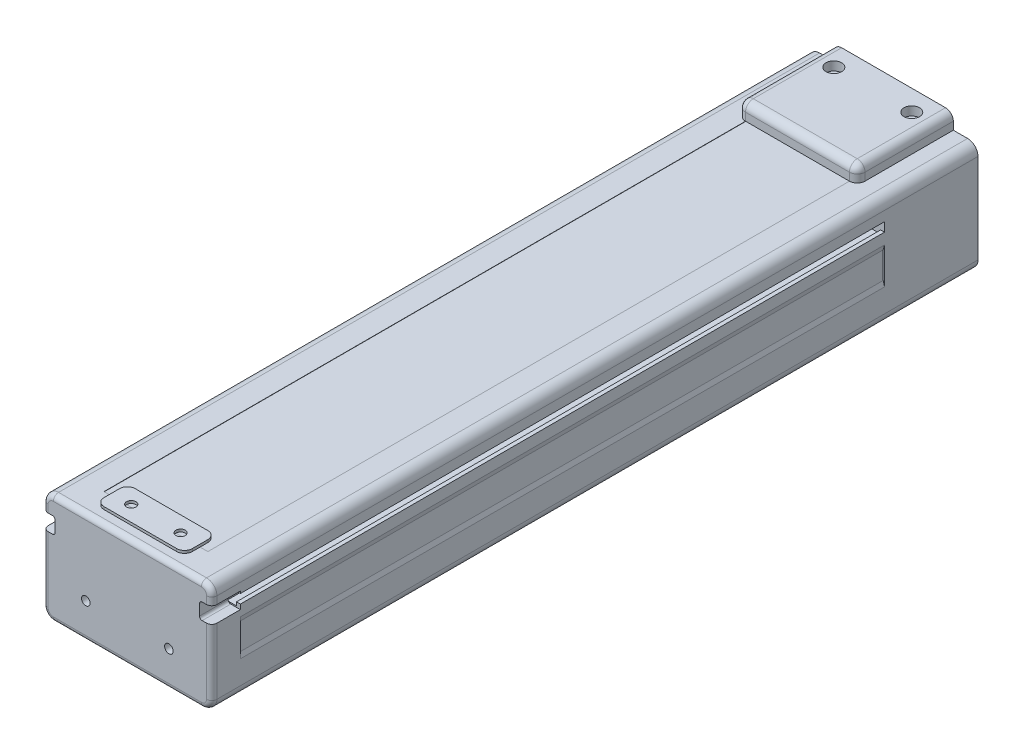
from build123d import *

# Parameters (mm, degrees)
EXTRUDE_1_DEPTH                     = 259
HOLE_WIZARD_M4_1_D                  = 4.4
HOLE_WIZARD_M4_1_CBORE_D            = 8
HOLE_WIZARD_M4_1_CBORE_DEPTH        = 4.2
PATTERN_LINEAR_1_COUNT              = 2
PATTERN_LINEAR_1_PITCH              = 23
PATTERN_LINEAR_2_COUNT              = 2
PATTERN_LINEAR_2_PITCH              = 11
PATTERN_LINEAR_2_COPY_1_D           = 4.4
PATTERN_LINEAR_2_COPY_1_CBORE_D     = 8
PATTERN_LINEAR_2_COPY_1_CBORE_DEPTH = 4.2
HOLE_WIZARD_M5_1_D                  = 4.2
PATTERN_LINEAR_4_COUNT              = 2
PATTERN_LINEAR_4_PITCH              = 23
PATTERN_LINEAR_5_COUNT              = 6
PATTERN_LINEAR_5_PITCH              = 40
PATTERN_LINEAR_5_COPY_1_D           = 4.2
PATTERN_LINEAR_5_COPY_2_D           = 4.2
PATTERN_LINEAR_5_COPY_3_D           = 4.2
PATTERN_LINEAR_5_COPY_4_D           = 4.2
PATTERN_LINEAR_5_COPY_5_D           = 4.2
HOLE_WIZARD_M4_2_D                  = 4.4
HOLE_WIZARD_M4_2_CBORE_D            = 8
HOLE_WIZARD_M4_2_CBORE_DEPTH        = 4.2
EXTRUDE_2_DEPTH                     = 248
EXTRUDE_6_DEPTH                     = 11
FILLET_1_R                          = 1
FILLET_2_R                          = 4
EXTRUDE_7_DEPTH                     = 36
CUT_EXTRUDE_1_DEPTH                 = 9
EXTRUDE_8_DEPTH                     = 6
FILLET_3_R                          = 3
SKETCH_14_W                         = 40
SKETCH_14_H                         = 257
CUT_EXTRUDE_2_DEPTH                 = 0.1
SKETCH_15_W                         = 34
SKETCH_15_H                         = 12
SKETCH_15_R                         = 1.8
EXTRUDE_9_DEPTH                     = 1
FILLET_4_R                          = 3
HOLE_WIZARD_M3_1_D                  = 3.4
HOLE_WIZARD_M3_1_DEPTH              = 6
HOLE_WIZARD_M3_1_CBORE_D            = 6
HOLE_WIZARD_M3_1_CBORE_DEPTH        = 3.4
HOLE_WIZARD_M3_1_TIP                = 1.021463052
HOLE_WIZARD_M4_3_D                  = 4.4
HOLE_WIZARD_M4_3_DEPTH              = 10
HOLE_WIZARD_M4_3_CBORE_D            = 8
HOLE_WIZARD_M4_3_CBORE_DEPTH        = 4.2
HOLE_WIZARD_M4_3_TIP                = 1.321893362
FILLET_5_R                          = 2
HOLE_WIZARD_M4_1_2_D                = 3.3
HOLE_WIZARD_M4_1_2_DEPTH            = 14.1
HOLE_WIZARD_M4_1_2_TIP              = 0.991420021


with BuildPart() as part:
    # Sketch 1 → Extrude 1 (new body)
    with BuildSketch(Plane.XY):
        with BuildLine():
            Line((-20.85, 3.480384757), (-20.4, 3.740192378))
            ThreePointArc((-20.4, 3.740192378), (-20.290192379, 3.85), (-20.25, 4))
            Line((-20.25, 4), (-20.25, 5.134886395))
            ThreePointArc((-20.25, 5.134886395), (-19.030626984, 6.766047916), (-20.250994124, 8.396465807))
            Line((-20.250994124, 8.396465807), (-20.628312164, 9.05))
            ThreePointArc((-20.628312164, 9.05), (-20.628312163, 9.35), (-20.368504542, 9.5))
            Line((-20.368504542, 9.5), (20.368504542, 9.5))
            ThreePointArc((20.368504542, 9.5), (20.628312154, 9.350000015), (20.628312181, 9.050000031))
            Line((20.628312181, 9.050000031), (20.250994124, 8.396465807))
            ThreePointArc((20.250994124, 8.396465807), (19.030626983, 6.766047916), (20.25, 5.134886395))
            Line((20.25, 5.134886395), (20.25, 3.999999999))
            ThreePointArc((20.25, 3.999999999), (20.290192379, 3.85), (20.4, 3.740192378))
            Line((20.4, 3.740192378), (20.85, 3.480384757))
            ThreePointArc((20.85, 3.480384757), (20.959807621, 3.370577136), (21, 3.220577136))
            Line((21, 3.220577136), (21, 0.815685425))
            Line((21, 0.815685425), (20.184314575, 0))
            Line((20.184314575, 0), (9, 0))
            Line((9, 0), (8.5, 0.5))
            Line((8.5, 0.5), (-8.5, 0.5))
            Line((-8.5, 0.5), (-9, 0))
            Line((-9, 0), (-20.184314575, 0))
            Line((-20.184314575, 0), (-21, 0.815685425))
            Line((-21, 0.815685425), (-21, 3.220577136))
            ThreePointArc((-21, 3.220577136), (-20.959807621, 3.370577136), (-20.85, 3.480384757))
        make_face()
    extrude(amount=EXTRUDE_1_DEPTH)

    # Hole Wizard M4 _1 (through all)
    with Locations(Plane(origin=(-11.5, 0, 5), x_dir=(0, 0, -1), z_dir=(0, -1, 0))):
        with Locations((0, 0)):
            hole_wizard_m4_1 = CounterBoreHole(HOLE_WIZARD_M4_1_D / 2, HOLE_WIZARD_M4_1_CBORE_D / 2, HOLE_WIZARD_M4_1_CBORE_DEPTH)

    # Pattern Linear 1: Hole Wizard M4 _1 ×2
    with Locations(*[(i * PATTERN_LINEAR_1_PITCH, 0, 0) for i in range(1, PATTERN_LINEAR_1_COUNT)]):
        add(hole_wizard_m4_1, mode=Mode.SUBTRACT)

    # Pattern Linear 2: Hole Wizard M4 _1 ×2
    with Locations(*[(0, 0, i * PATTERN_LINEAR_2_PITCH) for i in range(1, PATTERN_LINEAR_2_COUNT)]):
        add(hole_wizard_m4_1, mode=Mode.SUBTRACT)

    # Pattern Linear 2 copy 1 (through all)
    with Locations(Plane(origin=(11.5, 0, 16), x_dir=(0, 0, -1), z_dir=(0, -1, 0))):
        with Locations((0, 0)):
            CounterBoreHole(PATTERN_LINEAR_2_COPY_1_D / 2, PATTERN_LINEAR_2_COPY_1_CBORE_D / 2, PATTERN_LINEAR_2_COPY_1_CBORE_DEPTH)

    # Hole Wizard M5 _1 (through all)
    with Locations(Plane(origin=(-11.5, 9.5, 34), x_dir=(0, 0, 1), z_dir=(0, 1, 0))):
        with Locations((0, 0)):
            hole_wizard_m5_1 = Hole(HOLE_WIZARD_M5_1_D / 2)

    # Pattern Linear 4: Hole Wizard M5 _1 ×2
    with Locations(*[(i * PATTERN_LINEAR_4_PITCH, 0, 0) for i in range(1, PATTERN_LINEAR_4_COUNT)]):
        add(hole_wizard_m5_1, mode=Mode.SUBTRACT)

    # Pattern Linear 5: Hole Wizard M5 _1 ×6
    with Locations(*[(0, 0, i * PATTERN_LINEAR_5_PITCH) for i in range(1, PATTERN_LINEAR_5_COUNT)]):
        add(hole_wizard_m5_1, mode=Mode.SUBTRACT)

    # Pattern Linear 5 copy 1 (through all)
    with Locations(Plane(origin=(11.5, 9.5, 74), x_dir=(0, 0, 1), z_dir=(0, 1, 0))):
        with Locations((0, 0)):
            Hole(PATTERN_LINEAR_5_COPY_1_D / 2)

    # Pattern Linear 5 copy 2 (through all)
    with Locations(Plane(origin=(11.5, 9.5, 114), x_dir=(0, 0, 1), z_dir=(0, 1, 0))):
        with Locations((0, 0)):
            Hole(PATTERN_LINEAR_5_COPY_2_D / 2)

    # Pattern Linear 5 copy 3 (through all)
    with Locations(Plane(origin=(11.5, 9.5, 154), x_dir=(0, 0, 1), z_dir=(0, 1, 0))):
        with Locations((0, 0)):
            Hole(PATTERN_LINEAR_5_COPY_3_D / 2)

    # Pattern Linear 5 copy 4 (through all)
    with Locations(Plane(origin=(11.5, 9.5, 194), x_dir=(0, 0, 1), z_dir=(0, 1, 0))):
        with Locations((0, 0)):
            Hole(PATTERN_LINEAR_5_COPY_4_D / 2)

    # Pattern Linear 5 copy 5 (through all)
    with Locations(Plane(origin=(11.5, 9.5, 234), x_dir=(0, 0, 1), z_dir=(0, 1, 0))):
        with Locations((0, 0)):
            Hole(PATTERN_LINEAR_5_COPY_5_D / 2)

    # Hole Wizard M4 _2 (through all)
    with Locations(Plane(origin=(-11.5, 0, 254), x_dir=(0, 0, -1), z_dir=(0, -1, 0))):
        with Locations((0, 0), (0, 23)):
            CounterBoreHole(HOLE_WIZARD_M4_2_D / 2, HOLE_WIZARD_M4_2_CBORE_D / 2, HOLE_WIZARD_M4_2_CBORE_DEPTH)

    # Sketch 10 → Extrude 6 (add)
    with BuildSketch(Plane.XY.offset(258)):
        Polygon((32.5, 43.9), (-32.5, 43.9), (-32.5, 37), (-27.8, 37), (-27.8, 30.8), (-32.5, 30.8), (-32.5, 1.4), (32.5, 1.4), (32.5, 30.8), (27.8, 30.8), (27.8, 37), (32.5, 37), align=None)
    extrude(amount=EXTRUDE_6_DEPTH)

    # Fillet 1
    fillet_1_edges = [part.edges().sort_by_distance(p)[0] for p in [
        (-27.8, 37, 263.5),
        (-27.8, 30.8, 263.5),
        (27.8, 30.8, 263.5),
        (27.8, 37, 263.5),
    ]]
    fillet(fillet_1_edges, radius=FILLET_1_R)

    # Fillet 2
    fillet_2_edges = [part.edges().sort_by_distance(p)[0] for p in [
        (-32.5, 1.4, 263.5),
        (-32.5, 43.9, 263.5),
        (32.5, 1.4, 263.5),
        (32.5, 43.9, 263.5),
    ]]
    fillet(fillet_2_edges, radius=FILLET_2_R)

    # Sketch 11 → Extrude 7 (add)
    with BuildSketch(Plane(origin=(0, 0, 10), x_dir=(-1, 0, 0), z_dir=(0, 0, -1))):
        with BuildLine():
            Line((-28.5, 43.9), (28.5, 43.9))
            ThreePointArc((28.5, 43.9), (31.328427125, 42.728427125), (32.5, 39.9))
            Line((32.5, 39.9), (32.5, 5.4))
            ThreePointArc((32.5, 5.4), (31.328427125, 2.571572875), (28.5, 1.4))
            Line((28.5, 1.4), (-28.5, 1.4))
            ThreePointArc((-28.5, 1.4), (-31.328427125, 2.571572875), (-32.5, 5.4))
            Line((-32.5, 5.4), (-32.5, 39.9))
            ThreePointArc((-32.5, 39.9), (-31.328427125, 42.728427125), (-28.5, 43.9))
        make_face()
    extrude(amount=EXTRUDE_7_DEPTH)

    # Sketch 12 → Cut-Extrude 1 (cut)
    with BuildSketch(Plane.XZ.offset(-0.5)):
        with BuildLine():
            Line((-21, 0), (21, 0))
            Line((21, 0), (21, -3))
            ThreePointArc((21, -3), (19.828427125, -5.828427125), (17, -7))
            Line((17, -7), (-17, -7))
            ThreePointArc((-17, -7), (-19.828427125, -5.828427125), (-21, -3))
            Line((-21, -3), (-21, 0))
        make_face()
        with BuildLine():
            Line((21, 259), (-21, 259))
            Line((-21, 259), (-21, 260))
            ThreePointArc((-21, 260), (-19.828427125, 262.828427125), (-17, 264))
            Line((-17, 264), (17, 264))
            ThreePointArc((17, 264), (19.828427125, 262.828427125), (21, 260))
            Line((21, 260), (21, 259))
        make_face()
    extrude(amount=-CUT_EXTRUDE_1_DEPTH, mode=Mode.SUBTRACT)



with BuildPart() as body_2:
    # Sketch 9 → Extrude 2 (new body)
    with BuildSketch(Plane.XY.offset(258)):
        with BuildLine():
            Line((-32, 26.5), (-32, 16.3))
            Line((-32, 16.3), (-32.5, 14.4))
            Line((-32.5, 14.4), (-32.5, 5.4))
            ThreePointArc((-32.5, 5.4), (-31.328427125, 2.571572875), (-28.5, 1.4))
            Line((-28.5, 1.4), (-18.5, 1.4))
            Line((-18.5, 1.4), (-18.5, 9.5))
            Line((-18.5, 9.5), (18.5, 9.5))
            Line((18.5, 9.5), (18.5, 1.4))
            Line((18.5, 1.4), (28.5, 1.4))
            ThreePointArc((28.5, 1.4), (31.328427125, 2.571572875), (32.5, 5.4))
            Line((32.5, 5.4), (32.5, 14.4))
            Line((32.5, 14.4), (32, 16.3))
            Line((32, 16.3), (32, 26.5))
            Line((32, 26.5), (32.5, 28.4))
            Line((32.5, 28.4), (32.5, 32.65))
            Line((32.5, 32.65), (31, 32.65))
            Line((31, 32.65), (31, 31.3))
            Line((31, 31.3), (27.3, 31.3))
            Line((27.3, 31.3), (27.3, 37.5))
            Line((27.3, 37.5), (31, 37.5))
            Line((31, 37.5), (31, 36.15))
            Line((31, 36.15), (32.5, 36.15))
            Line((32.5, 36.15), (32.5, 39.9))
            ThreePointArc((32.5, 39.9), (31.328427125, 42.728427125), (28.5, 43.9))
            Line((28.5, 43.9), (0, 43.9))
            Line((0, 43.9), (-28.5, 43.9))
            ThreePointArc((-28.5, 43.9), (-31.328427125, 42.728427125), (-32.5, 39.9))
            Line((-32.5, 39.9), (-32.5, 36.15))
            Line((-32.5, 36.15), (-31, 36.15))
            Line((-31, 36.15), (-31, 37.5))
            Line((-31, 37.5), (-27.3, 37.5))
            Line((-27.3, 37.5), (-27.3, 31.3))
            Line((-27.3, 31.3), (-31, 31.3))
            Line((-31, 31.3), (-31, 32.65))
            Line((-31, 32.65), (-32.5, 32.65))
            Line((-32.5, 32.65), (-32.5, 28.4))
            Line((-32.5, 28.4), (-32, 26.5))
        make_face()
    extrude(amount=-EXTRUDE_2_DEPTH)


with BuildPart() as part_1:
    add(part.part)

    add(body_2.part)  # Extrude 8 merges body 2
    # Sketch 13 → Extrude 8 (add)
    with BuildSketch(Plane(origin=(0, 43.9, 0), x_dir=(1, 0, 0), z_dir=(0, 1, 0))):
        with BuildLine():
            Line((-23, 26), (23, 26))
            Line((23, 26), (23, -8))
            ThreePointArc((23, -8), (22.121320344, -10.121320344), (20, -11))
            Line((20, -11), (-20, -11))
            ThreePointArc((-20, -11), (-22.121320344, -10.121320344), (-23, -8))
            Line((-23, -8), (-23, 26))
        make_face()
    extrude(amount=EXTRUDE_8_DEPTH)

    # Fillet 3
    fillet_3_edges = [part_1.edges().sort_by_distance(p)[0] for p in [
        (-23, 49.9, -9),
        (-22.121320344, 49.9, 10.121320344),
        (0, 49.9, 11),
        (22.121320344, 49.9, 10.121320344),
        (23, 49.9, -9),
    ]]
    fillet(fillet_3_edges, radius=FILLET_3_R)

    # Sketch 14 → Cut-Extrude 2 (cut)
    with BuildSketch(Plane(origin=(0, 43.9, 0), x_dir=(1, 0, 0), z_dir=(0, 1, 0))):
        with Locations((0, -129.5)):
            Rectangle(SKETCH_14_W, SKETCH_14_H)
    extrude(amount=-CUT_EXTRUDE_2_DEPTH, mode=Mode.SUBTRACT)

    # Sketch 15 → Extrude 9 (add)
    with BuildSketch(Plane(origin=(0, 43.9, 0), x_dir=(1, 0, 0), z_dir=(0, 1, 0))):
        with Locations((0, -258)):
            Rectangle(SKETCH_15_W, SKETCH_15_H)
        with Locations((-9.5, -258)):
            Circle(SKETCH_15_R, mode=Mode.SUBTRACT)
        with Locations(Location((9.5, -258, 0), (0, 0, 90))):
            Circle(SKETCH_15_R, mode=Mode.SUBTRACT)
    extrude(amount=EXTRUDE_9_DEPTH)

    # Fillet 4
    fillet_4_edges = [part_1.edges().sort_by_distance(p)[0] for p in [
        (-17, 44.4, 252),
        (-17, 44.4, 264),
        (17, 44.4, 264),
        (17, 44.4, 252),
    ]]
    fillet(fillet_4_edges, radius=FILLET_4_R)

    # Hole Wizard M3 _1
    with Locations(Plane(origin=(0, 49.9, 0), x_dir=(1, 0, 0), z_dir=(0, 1, 0))):
        with Locations((-15, 18), (15, 18)):
            CounterBoreHole(HOLE_WIZARD_M3_1_D / 2, HOLE_WIZARD_M3_1_CBORE_D / 2, HOLE_WIZARD_M3_1_CBORE_DEPTH, depth=HOLE_WIZARD_M3_1_DEPTH)
            with Locations((0, 0, -(HOLE_WIZARD_M3_1_DEPTH + HOLE_WIZARD_M3_1_TIP / 2))):  # 118° drill point
                Cone(0, HOLE_WIZARD_M3_1_D / 2, HOLE_WIZARD_M3_1_TIP, mode=Mode.SUBTRACT)

    # Hole Wizard M4 _3
    with Locations(Plane(origin=(0, 0, 0), x_dir=(-1, 0, 0), z_dir=(0, -1, 0))):
        with Locations((11.5, -5), (-11.5, -5)):
            CounterBoreHole(HOLE_WIZARD_M4_3_D / 2, HOLE_WIZARD_M4_3_CBORE_D / 2, HOLE_WIZARD_M4_3_CBORE_DEPTH, depth=HOLE_WIZARD_M4_3_DEPTH)
            with Locations((0, 0, -(HOLE_WIZARD_M4_3_DEPTH + HOLE_WIZARD_M4_3_TIP / 2))):  # 118° drill point
                Cone(0, HOLE_WIZARD_M4_3_D / 2, HOLE_WIZARD_M4_3_TIP, mode=Mode.SUBTRACT)

    # Fillet 5
    fillet_5_edges = [part_1.edges().sort_by_distance(p)[0] for p in [
        (-32.5, 18.1, 269),
        (-31.328427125, 2.571572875, 269),
        (0, 1.4, 269),
        (31.328427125, 2.571572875, 269),
        (32.5, 18.1, 269),
        (32.5, 38.45, 269),
        (31.328427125, 42.728427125, 269),
        (0, 43.9, 269),
        (-31.328427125, 42.728427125, 269),
        (-32.5, 38.45, 269),
    ]]
    fillet(fillet_5_edges, radius=FILLET_5_R)

    # Hole Wizard M4 _1 2
    with Locations(Plane.XY.offset(269)):
        with Locations((-16, 15), (16, 15)):
            Hole(HOLE_WIZARD_M4_1_2_D / 2, depth=HOLE_WIZARD_M4_1_2_DEPTH)
            with Locations((0, 0, -(HOLE_WIZARD_M4_1_2_DEPTH + HOLE_WIZARD_M4_1_2_TIP / 2))):  # 118° drill point
                Cone(0, HOLE_WIZARD_M4_1_2_D / 2, HOLE_WIZARD_M4_1_2_TIP, mode=Mode.SUBTRACT)


solid = part_1.part
